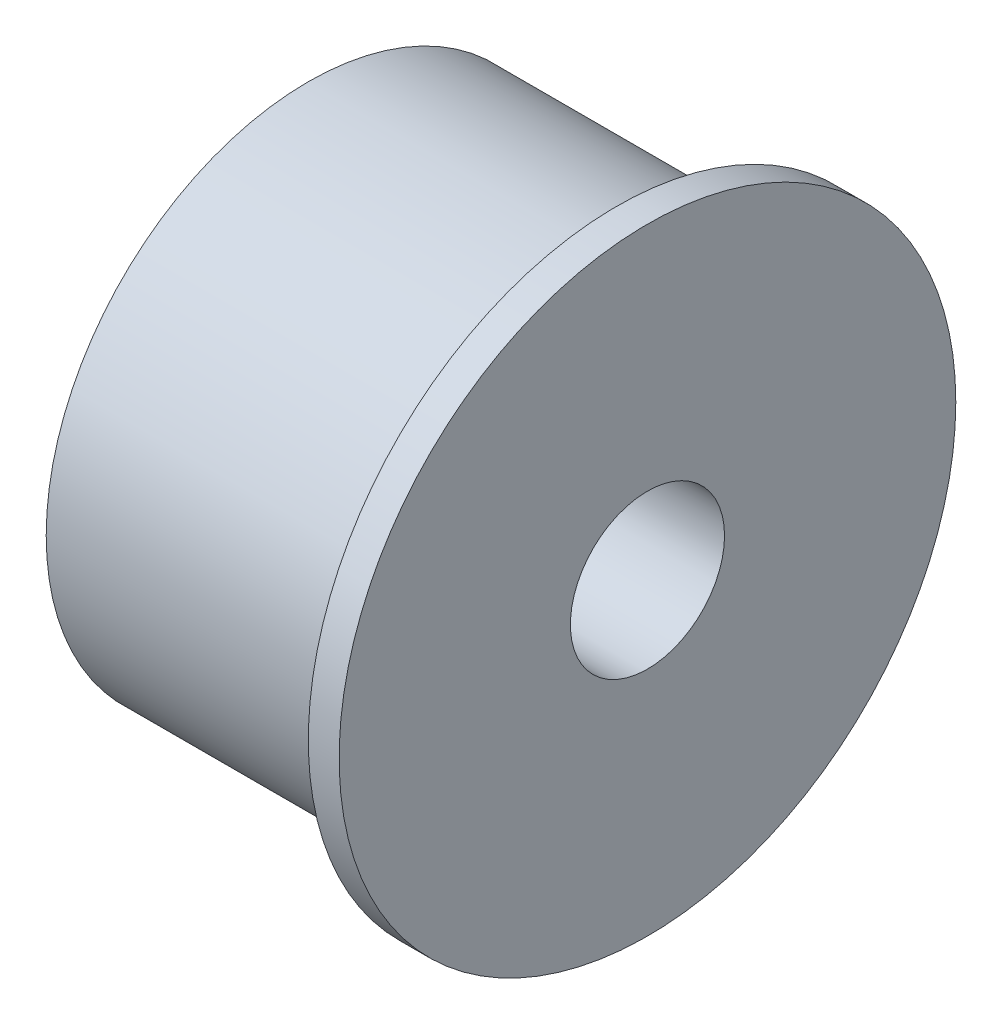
from build123d import *


with BuildPart() as part:
    # Esquisse1 → Base-R_volution (revolve)
    with BuildSketch(Plane.XY, mode=Mode.PRIVATE) as base_r_volution_sk:
        Polygon((-64.084303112, 17), (-64.084303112, 5), (-42.084303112, 5), (-42.084303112, 20), (-44.084303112, 20), (-44.084303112, 17), align=None)
    revolve(base_r_volution_sk.sketch.rotate(Axis((0, 0, 0), (-1, 0, 0)), 90), axis=Axis((0, 0, 0), (-1, 0, 0)))


solid = part.part
